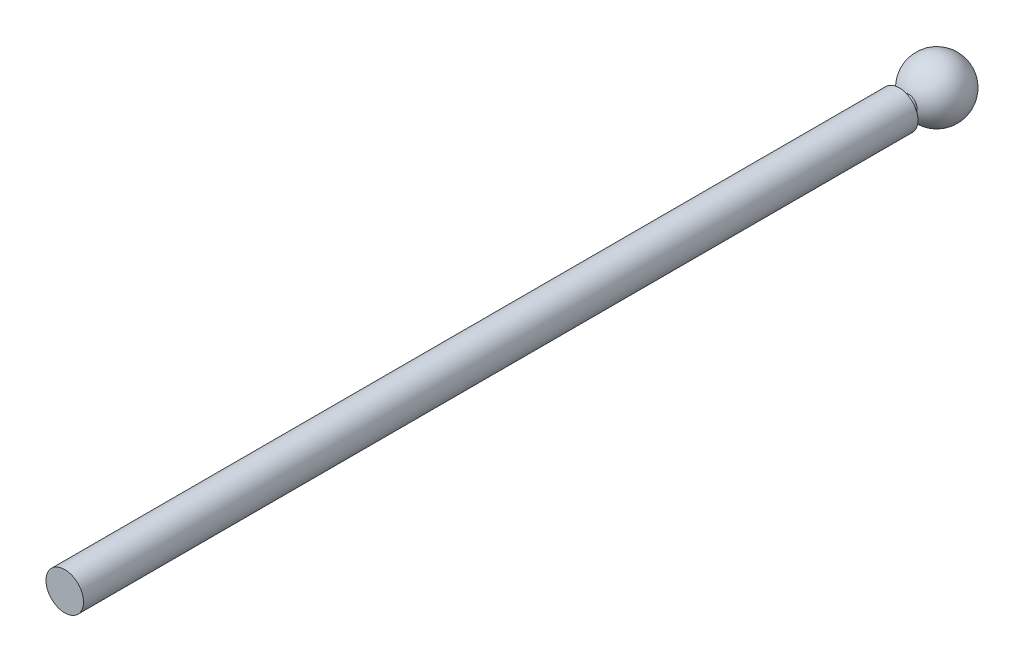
ISO-10303-21;
HEADER;
FILE_DESCRIPTION(('STEP AP214'),'2;1');
FILE_NAME('part.step','',(''),(''),'','','');
FILE_SCHEMA(('AUTOMOTIVE_DESIGN { 1 0 10303 214 1 1 1 1 }'));
ENDSEC;
DATA;
#1=APPLICATION_CONTEXT('core data for automotive mechanical design processes');
#2=APPLICATION_PROTOCOL_DEFINITION('international standard','automotive_design',2000,#1);
#3=PRODUCT_CONTEXT('',#1,'mechanical');
#4=PRODUCT('Part','Part','',(#3));
#5=PRODUCT_RELATED_PRODUCT_CATEGORY('part','',(#4));
#6=PRODUCT_DEFINITION_FORMATION('','',#4);
#7=PRODUCT_DEFINITION_CONTEXT('part definition',#1,'design');
#8=PRODUCT_DEFINITION('design','',#6,#7);
#9=PRODUCT_DEFINITION_SHAPE('','',#8);
#10=(LENGTH_UNIT() NAMED_UNIT(*) SI_UNIT(.MILLI.,.METRE.));
#11=(NAMED_UNIT(*) PLANE_ANGLE_UNIT() SI_UNIT($,.RADIAN.));
#12=(NAMED_UNIT(*) SI_UNIT($,.STERADIAN.) SOLID_ANGLE_UNIT());
#13=UNCERTAINTY_MEASURE_WITH_UNIT(LENGTH_MEASURE(1.E-05),#10,'distance_accuracy_value','');
#14=(GEOMETRIC_REPRESENTATION_CONTEXT(3) GLOBAL_UNCERTAINTY_ASSIGNED_CONTEXT((#13)) GLOBAL_UNIT_ASSIGNED_CONTEXT((#10,
#11,#12)) REPRESENTATION_CONTEXT('',''));
#15=CARTESIAN_POINT('',(0.,0.,0.));
#16=DIRECTION('',(0.,0.,1.));
#17=DIRECTION('',(1.,0.,0.));
#18=AXIS2_PLACEMENT_3D('',#15,#16,#17);
#19=CARTESIAN_POINT('',(0.,0.,0.));
#20=DIRECTION('',(0.,1.,0.));
#21=DIRECTION('',(1.,0.,0.));
#22=AXIS2_PLACEMENT_3D('',#19,#20,#21);
#23=SPHERICAL_SURFACE('',#22,35.);
#24=CARTESIAN_POINT('',(0.,0.,0.));
#25=DIRECTION('',(0.,0.,-1.));
#26=DIRECTION('',(-1.,0.,0.));
#27=AXIS2_PLACEMENT_3D('',#24,#25,#26);
#28=SPHERICAL_SURFACE('',#27,35.);
#29=CARTESIAN_POINT('',(0.,0.,33.5410196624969));
#30=DIRECTION('',(0.,0.,-1.));
#31=DIRECTION('',(-1.,0.,0.));
#32=AXIS2_PLACEMENT_3D('',#29,#30,#31);
#33=CIRCLE('',#32,10.);
#34=CARTESIAN_POINT('',(-10.,0.,33.5410196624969));
#35=VERTEX_POINT('',#34);
#36=EDGE_CURVE('E10',#35,#35,#33,.F.);
#37=ORIENTED_EDGE('',*,*,#36,.F.);
#38=EDGE_LOOP('',(#37));
#39=FACE_BOUND('',#38,.T.);
#40=ADVANCED_FACE('F31',(#39),#28,.T.);
#41=CARTESIAN_POINT('',(0.,0.,45.));
#42=DIRECTION('',(0.,0.,-1.));
#43=DIRECTION('',(-1.,0.,0.));
#44=AXIS2_PLACEMENT_3D('',#41,#42,#43);
#45=CYLINDRICAL_SURFACE('',#44,10.);
#46=CARTESIAN_POINT('',(0.,0.,45.));
#47=DIRECTION('',(0.,0.,1.));
#48=DIRECTION('',(1.,0.,0.));
#49=AXIS2_PLACEMENT_3D('',#46,#47,#48);
#50=CIRCLE('',#49,10.);
#51=CARTESIAN_POINT('',(-10.,0.,45.));
#52=VERTEX_POINT('',#51);
#53=EDGE_CURVE('E37',#52,#52,#50,.T.);
#54=CARTESIAN_POINT('',(-10.,0.,45.));
#55=CARTESIAN_POINT('',(-10.,0.,44.8806356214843));
#56=CARTESIAN_POINT('',(-10.,0.,44.7612712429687));
#57=CARTESIAN_POINT('',(-10.,0.,44.5225424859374));
#58=CARTESIAN_POINT('',(-10.,0.,44.4031781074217));
#59=CARTESIAN_POINT('',(-10.,0.,44.1644493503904));
#60=CARTESIAN_POINT('',(-10.,0.,44.0450849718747));
#61=CARTESIAN_POINT('',(-10.,0.,43.8063562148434));
#62=CARTESIAN_POINT('',(-10.,0.,43.6869918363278));
#63=CARTESIAN_POINT('',(-10.,0.,43.4482630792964));
#64=CARTESIAN_POINT('',(-10.,0.,43.3288987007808));
#65=CARTESIAN_POINT('',(-10.,0.,43.0901699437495));
#66=CARTESIAN_POINT('',(-10.,0.,42.9708055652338));
#67=CARTESIAN_POINT('',(-10.,0.,42.7320768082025));
#68=CARTESIAN_POINT('',(-10.,0.,42.6127124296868));
#69=CARTESIAN_POINT('',(-10.,0.,42.3739836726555));
#70=CARTESIAN_POINT('',(-10.,0.,42.2546192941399));
#71=CARTESIAN_POINT('',(-10.,0.,42.0158905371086));
#72=CARTESIAN_POINT('',(-10.,0.,41.8965261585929));
#73=CARTESIAN_POINT('',(-10.,0.,41.6577974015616));
#74=CARTESIAN_POINT('',(-10.,0.,41.5384330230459));
#75=CARTESIAN_POINT('',(-10.,0.,41.2997042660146));
#76=CARTESIAN_POINT('',(-10.,0.,41.180339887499));
#77=CARTESIAN_POINT('',(-10.,0.,40.9416111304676));
#78=CARTESIAN_POINT('',(-10.,0.,40.822246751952));
#79=CARTESIAN_POINT('',(-10.,0.,40.5835179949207));
#80=CARTESIAN_POINT('',(-10.,0.,40.464153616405));
#81=CARTESIAN_POINT('',(-10.,0.,40.2254248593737));
#82=CARTESIAN_POINT('',(-10.,0.,40.106060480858));
#83=CARTESIAN_POINT('',(-10.,0.,39.8673317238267));
#84=CARTESIAN_POINT('',(-10.,0.,39.7479673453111));
#85=CARTESIAN_POINT('',(-10.,0.,39.5092385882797));
#86=CARTESIAN_POINT('',(-10.,0.,39.3898742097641));
#87=CARTESIAN_POINT('',(-10.,0.,39.1511454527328));
#88=CARTESIAN_POINT('',(-10.,0.,39.0317810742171));
#89=CARTESIAN_POINT('',(-10.,0.,38.7930523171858));
#90=CARTESIAN_POINT('',(-10.,0.,38.6736879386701));
#91=CARTESIAN_POINT('',(-10.,0.,38.4349591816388));
#92=CARTESIAN_POINT('',(-10.,0.,38.3155948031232));
#93=CARTESIAN_POINT('',(-10.,0.,38.0768660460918));
#94=CARTESIAN_POINT('',(-10.,0.,37.9575016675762));
#95=CARTESIAN_POINT('',(-10.,0.,37.7187729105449));
#96=CARTESIAN_POINT('',(-10.,0.,37.5994085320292));
#97=CARTESIAN_POINT('',(-10.,0.,37.3606797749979));
#98=CARTESIAN_POINT('',(-10.,0.,37.2413153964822));
#99=CARTESIAN_POINT('',(-10.,0.,37.0025866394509));
#100=CARTESIAN_POINT('',(-10.,0.,36.8832222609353));
#101=CARTESIAN_POINT('',(-10.,0.,36.644493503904));
#102=CARTESIAN_POINT('',(-10.,0.,36.5251291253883));
#103=CARTESIAN_POINT('',(-10.,0.,36.286400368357));
#104=CARTESIAN_POINT('',(-10.,0.,36.1670359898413));
#105=CARTESIAN_POINT('',(-10.,0.,35.92830723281));
#106=CARTESIAN_POINT('',(-10.,0.,35.8089428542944));
#107=CARTESIAN_POINT('',(-10.,0.,35.570214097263));
#108=CARTESIAN_POINT('',(-10.,0.,35.4508497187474));
#109=CARTESIAN_POINT('',(-10.,0.,35.2121209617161));
#110=CARTESIAN_POINT('',(-10.,0.,35.0927565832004));
#111=CARTESIAN_POINT('',(-10.,0.,34.8540278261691));
#112=CARTESIAN_POINT('',(-10.,0.,34.7346634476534));
#113=CARTESIAN_POINT('',(-10.,0.,34.4959346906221));
#114=CARTESIAN_POINT('',(-10.,0.,34.3765703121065));
#115=CARTESIAN_POINT('',(-10.,0.,34.1378415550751));
#116=CARTESIAN_POINT('',(-10.,0.,34.0184771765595));
#117=CARTESIAN_POINT('',(-10.,0.,33.7797484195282));
#118=CARTESIAN_POINT('',(-10.,0.,33.6603840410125));
#119=CARTESIAN_POINT('',(-10.,0.,33.5410196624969));
#120=B_SPLINE_CURVE_WITH_KNOTS('',3,(#54,#55,#56,#57,#58,#59,#60,#61,#62,#63,#64,#65,#66,#67,
#68,#69,#70,#71,#72,#73,#74,#75,#76,#77,#78,#79,#80,#81,#82,#83,#84,#85,#86,#87,#88,#89,#90,#91,
#92,#93,#94,#95,#96,#97,#98,#99,#100,#101,#102,#103,#104,#105,#106,#107,#108,#109,#110,#111,
#112,#113,#114,#115,#116,#117,#118,#119),.UNSPECIFIED.,.F.,.F.,(4,2,2,2,2,2,2,2,2,2,2,2,2,2,2,2,
2,2,2,2,2,2,2,2,2,2,2,2,2,2,2,2,4),(0.,0.358093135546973,0.716186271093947,1.07427940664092,
1.43237254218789,1.79046567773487,2.14855881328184,2.50665194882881,2.86474508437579,
3.22283821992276,3.58093135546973,3.93902449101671,4.29711762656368,4.65521076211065,
5.01330389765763,5.3713970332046,5.72949016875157,6.08758330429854,6.44567643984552,
6.80376957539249,7.16186271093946,7.51995584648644,7.87804898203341,8.23614211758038,
8.59423525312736,8.95232838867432,9.3104215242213,9.66851465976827,10.0266077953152,
10.3847009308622,10.7427940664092,11.1008872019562,11.4589803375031),.UNSPECIFIED.);
#121=EDGE_CURVE('BSEAM55',#52,#35,#120,.T.);
#122=ORIENTED_EDGE('',*,*,#53,.F.);
#123=ORIENTED_EDGE('',*,*,#36,.T.);
#124=ORIENTED_EDGE('',*,*,#121,.T.);
#125=ORIENTED_EDGE('',*,*,#121,.F.);
#126=EDGE_LOOP('',(#122,#124,#123,#125));
#127=FACE_BOUND('',#126,.T.);
#128=ADVANCED_FACE('F55',(#127),#45,.T.);
#129=CARTESIAN_POINT('',(0.,0.,45.));
#130=DIRECTION('',(0.,0.,1.));
#131=DIRECTION('',(1.,0.,0.));
#132=AXIS2_PLACEMENT_3D('',#129,#130,#131);
#133=PLANE('',#132);
#134=CARTESIAN_POINT('',(0.,0.,45.));
#135=DIRECTION('',(0.,0.,1.));
#136=DIRECTION('',(1.,0.,0.));
#137=AXIS2_PLACEMENT_3D('',#134,#135,#136);
#138=CIRCLE('',#137,22.5);
#139=CARTESIAN_POINT('',(22.5,0.,45.));
#140=VERTEX_POINT('',#139);
#141=EDGE_CURVE('E45',#140,#140,#138,.T.);
#142=ORIENTED_EDGE('',*,*,#141,.F.);
#143=EDGE_LOOP('',(#142));
#144=FACE_BOUND('',#143,.T.);
#145=ORIENTED_EDGE('',*,*,#53,.T.);
#146=EDGE_LOOP('',(#145));
#147=FACE_BOUND('',#146,.T.);
#148=ADVANCED_FACE('F53',(#144,#147),#133,.F.);
#149=CARTESIAN_POINT('',(0.,0.,1045.));
#150=DIRECTION('',(0.,0.,-1.));
#151=DIRECTION('',(-1.,0.,0.));
#152=AXIS2_PLACEMENT_3D('',#149,#150,#151);
#153=CYLINDRICAL_SURFACE('',#152,22.5);
#154=CARTESIAN_POINT('',(0.,0.,1045.));
#155=DIRECTION('',(0.,0.,1.));
#156=DIRECTION('',(1.,0.,0.));
#157=AXIS2_PLACEMENT_3D('',#154,#155,#156);
#158=CIRCLE('',#157,22.5);
#159=CARTESIAN_POINT('',(22.5,0.,1045.));
#160=VERTEX_POINT('',#159);
#161=EDGE_CURVE('E41',#160,#160,#158,.T.);
#162=ORIENTED_EDGE('',*,*,#161,.F.);
#163=EDGE_LOOP('',(#162));
#164=FACE_BOUND('',#163,.T.);
#165=ORIENTED_EDGE('',*,*,#141,.T.);
#166=EDGE_LOOP('',(#165));
#167=FACE_BOUND('',#166,.T.);
#168=ADVANCED_FACE('F51',(#164,#167),#153,.T.);
#169=CARTESIAN_POINT('',(0.,0.,1045.));
#170=DIRECTION('',(0.,0.,1.));
#171=DIRECTION('',(1.,0.,0.));
#172=AXIS2_PLACEMENT_3D('',#169,#170,#171);
#173=PLANE('',#172);
#174=ORIENTED_EDGE('',*,*,#161,.T.);
#175=EDGE_LOOP('',(#174));
#176=FACE_BOUND('',#175,.T.);
#177=ADVANCED_FACE('F61',(#176),#173,.T.);
#178=CLOSED_SHELL('',(#40,#128,#148,#168,#177));
#179=MANIFOLD_SOLID_BREP('B2',#178);
#180=ADVANCED_BREP_SHAPE_REPRESENTATION('',(#18,#179),#14);
#181=SHAPE_DEFINITION_REPRESENTATION(#9,#180);
ENDSEC;
END-ISO-10303-21;
